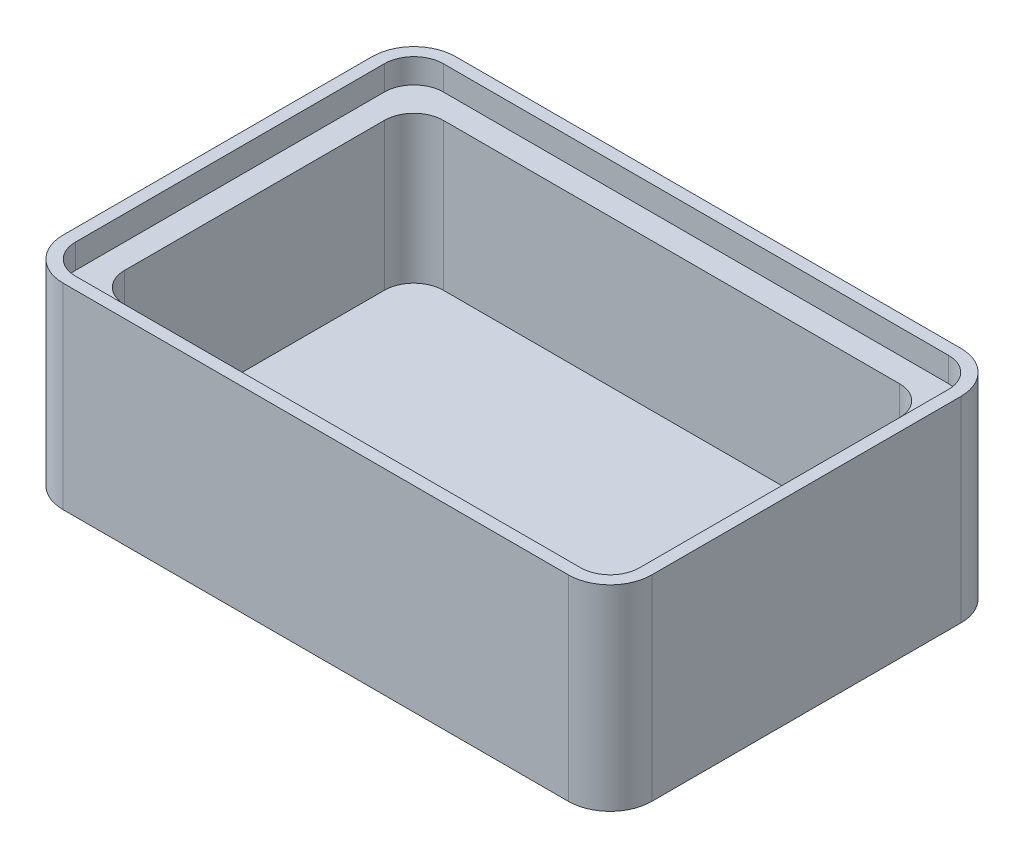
from build123d import *

# Parameters (mm, degrees)
SKETCH1_W          = 152.4
SKETCH1_H          = 101.6
EXTRUDE1_DEPTH     = 50.8
SKETCH2_W          = 133.35
SKETCH2_H          = 82.55
CUT_EXTRUDE1_DEPTH = 44.45
SKETCH3_W          = 146.05
SKETCH3_H          = 95.25
CUT_EXTRUDE2_DEPTH = 6.35
FILLET1_R          = 7.62
FILLET2_R          = 10.795


with BuildPart() as part:
    # Sketch1 → Extrude1 (new body)
    with BuildSketch(Plane(origin=(0, 0, 0), x_dir=(1, 0, 0), z_dir=(0, 1, 0))):
        Rectangle(SKETCH1_W, SKETCH1_H)
    extrude(amount=EXTRUDE1_DEPTH)

    # Sketch2 → Cut-Extrude1 (cut)
    with BuildSketch(Plane(origin=(0, 50.8, 0), x_dir=(-1, 0, 0), z_dir=(0, 1, 0))):
        Rectangle(SKETCH2_W, SKETCH2_H)
    extrude(amount=-CUT_EXTRUDE1_DEPTH, mode=Mode.SUBTRACT)

    # Sketch3 → Cut-Extrude2 (cut)
    with BuildSketch(Plane(origin=(0, 50.8, 0), x_dir=(-1, 0, 0), z_dir=(0, 1, 0))):
        Rectangle(SKETCH3_W, SKETCH3_H)
    extrude(amount=-CUT_EXTRUDE2_DEPTH, mode=Mode.SUBTRACT)

    # Fillet1
    fillet1_edges = [part.edges().sort_by_distance(p)[0] for p in [
        (-66.675, 25.4, -41.275),
        (66.675, 25.4, -41.275),
        (66.675, 25.4, 41.275),
        (-66.675, 25.4, 41.275),
        (-73.025, 47.625, -47.625),
        (73.025, 47.625, -47.625),
        (73.025, 47.625, 47.625),
        (-73.025, 47.625, 47.625),
    ]]
    fillet(fillet1_edges, radius=FILLET1_R)

    # Fillet2
    fillet2_edges = [part.edges().sort_by_distance(p)[0] for p in [
        (-76.2, 25.4, -50.8),
        (76.2, 25.4, -50.8),
        (76.2, 25.4, 50.8),
        (-76.2, 25.4, 50.8),
    ]]
    fillet(fillet2_edges, radius=FILLET2_R)


solid = part.part
